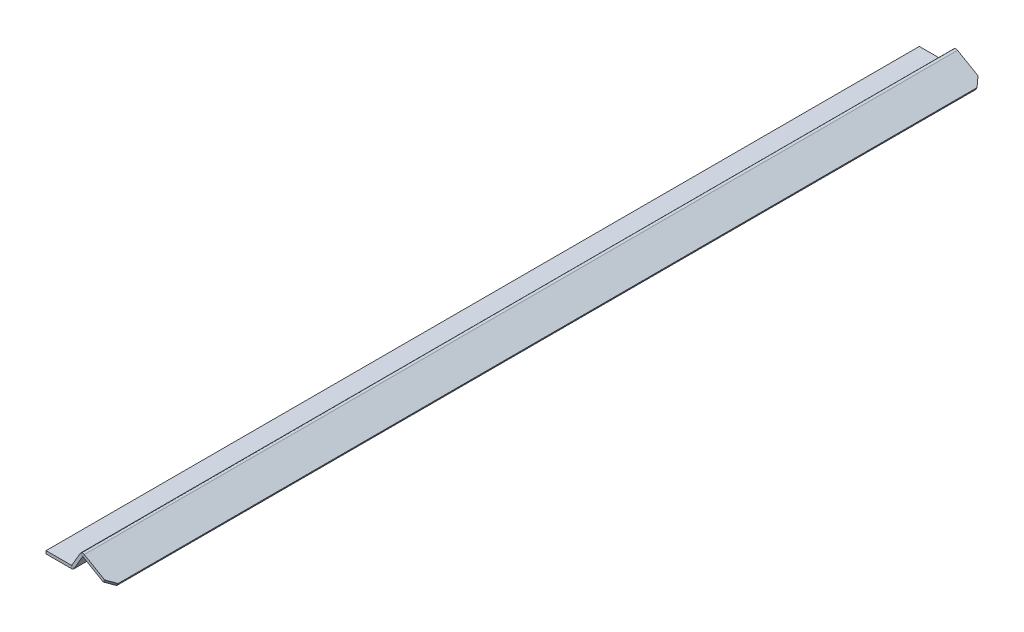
ISO-10303-21;
HEADER;
FILE_DESCRIPTION(('STEP AP214'),'2;1');
FILE_NAME('part.step','',(''),(''),'','','');
FILE_SCHEMA(('AUTOMOTIVE_DESIGN { 1 0 10303 214 1 1 1 1 }'));
ENDSEC;
DATA;
#1=APPLICATION_CONTEXT('core data for automotive mechanical design processes');
#2=APPLICATION_PROTOCOL_DEFINITION('international standard','automotive_design',2000,#1);
#3=PRODUCT_CONTEXT('',#1,'mechanical');
#4=PRODUCT('Part','Part','',(#3));
#5=PRODUCT_RELATED_PRODUCT_CATEGORY('part','',(#4));
#6=PRODUCT_DEFINITION_FORMATION('','',#4);
#7=PRODUCT_DEFINITION_CONTEXT('part definition',#1,'design');
#8=PRODUCT_DEFINITION('design','',#6,#7);
#9=PRODUCT_DEFINITION_SHAPE('','',#8);
#10=(LENGTH_UNIT() NAMED_UNIT(*) SI_UNIT(.MILLI.,.METRE.));
#11=(NAMED_UNIT(*) PLANE_ANGLE_UNIT() SI_UNIT($,.RADIAN.));
#12=(NAMED_UNIT(*) SI_UNIT($,.STERADIAN.) SOLID_ANGLE_UNIT());
#13=UNCERTAINTY_MEASURE_WITH_UNIT(LENGTH_MEASURE(1.E-05),#10,'distance_accuracy_value','');
#14=(GEOMETRIC_REPRESENTATION_CONTEXT(3) GLOBAL_UNCERTAINTY_ASSIGNED_CONTEXT((#13)) GLOBAL_UNIT_ASSIGNED_CONTEXT((#10,
#11,#12)) REPRESENTATION_CONTEXT('',''));
#15=CARTESIAN_POINT('',(0.,0.,0.));
#16=DIRECTION('',(0.,0.,1.));
#17=DIRECTION('',(1.,0.,0.));
#18=AXIS2_PLACEMENT_3D('',#15,#16,#17);
#19=CARTESIAN_POINT('',(17.7875644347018,0.,303.5));
#20=DIRECTION('',(0.,0.,1.));
#21=DIRECTION('',(1.,0.,0.));
#22=AXIS2_PLACEMENT_3D('',#19,#20,#21);
#23=PLANE('',#22);
#24=DIRECTION('',(0.,1.,0.));
#25=VECTOR('',#24,1.);
#26=CARTESIAN_POINT('',(17.7875644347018,0.,303.5));
#27=LINE('',#26,#25);
#28=CARTESIAN_POINT('',(17.7875644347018,0.,303.5));
#29=VERTEX_POINT('',#28);
#30=CARTESIAN_POINT('',(17.7875644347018,2.,303.5));
#31=VERTEX_POINT('',#30);
#32=EDGE_CURVE('E274',#29,#31,#27,.T.);
#33=ORIENTED_EDGE('',*,*,#32,.F.);
#34=CARTESIAN_POINT('',(17.7875644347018,2.1,303.5));
#35=DIRECTION('',(0.,0.,-1.));
#36=DIRECTION('',(-1.,0.,0.));
#37=AXIS2_PLACEMENT_3D('',#34,#35,#36);
#38=CIRCLE('',#37,2.1);
#39=CARTESIAN_POINT('',(19.6062177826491,1.05,303.5));
#40=VERTEX_POINT('',#39);
#41=EDGE_CURVE('E201',#29,#40,#38,.F.);
#42=ORIENTED_EDGE('',*,*,#41,.T.);
#43=DIRECTION('',(0.86602540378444,-0.499999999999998,0.));
#44=VECTOR('',#43,1.);
#45=CARTESIAN_POINT('',(17.8741669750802,2.05,303.5));
#46=LINE('',#45,#44);
#47=CARTESIAN_POINT('',(17.8741669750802,2.05,303.5));
#48=VERTEX_POINT('',#47);
#49=EDGE_CURVE('E272',#48,#40,#46,.T.);
#50=ORIENTED_EDGE('',*,*,#49,.F.);
#51=CARTESIAN_POINT('',(17.7875644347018,2.1,303.5));
#52=DIRECTION('',(0.,0.,1.));
#53=DIRECTION('',(1.,0.,0.));
#54=AXIS2_PLACEMENT_3D('',#51,#52,#53);
#55=CIRCLE('',#54,0.0999999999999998);
#56=EDGE_CURVE('E186',#31,#48,#55,.T.);
#57=ORIENTED_EDGE('',*,*,#56,.F.);
#58=EDGE_LOOP('',(#33,#42,#50,#57));
#59=FACE_BOUND('',#58,.T.);
#60=ADVANCED_FACE('F50',(#59),#23,.T.);
#61=CARTESIAN_POINT('',(17.8741669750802,2.05,303.5));
#62=DIRECTION('',(0.,0.,1.));
#63=DIRECTION('',(1.,0.,0.));
#64=AXIS2_PLACEMENT_3D('',#61,#62,#63);
#65=PLANE('',#64);
#66=DIRECTION('',(1.,0.,0.));
#67=VECTOR('',#66,1.);
#68=CARTESIAN_POINT('',(0.,0.,303.5));
#69=LINE('',#68,#67);
#70=CARTESIAN_POINT('',(0.,0.,303.5));
#71=VERTEX_POINT('',#70);
#72=EDGE_CURVE('E198',#71,#29,#69,.T.);
#73=ORIENTED_EDGE('',*,*,#72,.T.);
#74=ORIENTED_EDGE('',*,*,#32,.T.);
#75=DIRECTION('',(1.,0.,0.));
#76=VECTOR('',#75,1.);
#77=CARTESIAN_POINT('',(0.,2.,303.5));
#78=LINE('',#77,#76);
#79=CARTESIAN_POINT('',(0.,2.,303.5));
#80=VERTEX_POINT('',#79);
#81=EDGE_CURVE('E192',#80,#31,#78,.T.);
#82=ORIENTED_EDGE('',*,*,#81,.F.);
#83=DIRECTION('',(0.,1.,0.));
#84=VECTOR('',#83,1.);
#85=CARTESIAN_POINT('',(0.,0.,303.5));
#86=LINE('',#85,#84);
#87=EDGE_CURVE('E195',#71,#80,#86,.T.);
#88=ORIENTED_EDGE('',*,*,#87,.F.);
#89=EDGE_LOOP('',(#73,#74,#82,#88));
#90=FACE_BOUND('',#89,.T.);
#91=ADVANCED_FACE('F316',(#90),#65,.T.);
#92=CARTESIAN_POINT('',(19.6062177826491,1.05,-303.5));
#93=DIRECTION('',(0.,0.,-1.));
#94=DIRECTION('',(-1.,0.,0.));
#95=AXIS2_PLACEMENT_3D('',#92,#93,#94);
#96=PLANE('',#95);
#97=DIRECTION('',(-0.86602540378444,0.499999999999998,0.));
#98=VECTOR('',#97,1.);
#99=CARTESIAN_POINT('',(19.6062177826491,1.05,-303.5));
#100=LINE('',#99,#98);
#101=CARTESIAN_POINT('',(19.6062177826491,1.05,-303.5));
#102=VERTEX_POINT('',#101);
#103=CARTESIAN_POINT('',(17.8741669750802,2.05,-303.5));
#104=VERTEX_POINT('',#103);
#105=EDGE_CURVE('E270',#102,#104,#100,.T.);
#106=ORIENTED_EDGE('',*,*,#105,.F.);
#107=CARTESIAN_POINT('',(17.7875644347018,2.1,-303.5));
#108=DIRECTION('',(0.,0.,-1.));
#109=DIRECTION('',(-1.,0.,0.));
#110=AXIS2_PLACEMENT_3D('',#107,#108,#109);
#111=CIRCLE('',#110,2.1);
#112=CARTESIAN_POINT('',(17.7875644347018,0.,-303.5));
#113=VERTEX_POINT('',#112);
#114=EDGE_CURVE('E230',#113,#102,#111,.F.);
#115=ORIENTED_EDGE('',*,*,#114,.F.);
#116=DIRECTION('',(0.,-1.,0.));
#117=VECTOR('',#116,1.);
#118=CARTESIAN_POINT('',(17.7875644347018,2.,-303.5));
#119=LINE('',#118,#117);
#120=CARTESIAN_POINT('',(17.7875644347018,2.,-303.5));
#121=VERTEX_POINT('',#120);
#122=EDGE_CURVE('E268',#121,#113,#119,.T.);
#123=ORIENTED_EDGE('',*,*,#122,.F.);
#124=CARTESIAN_POINT('',(17.7875644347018,2.1,-303.5));
#125=DIRECTION('',(0.,0.,1.));
#126=DIRECTION('',(1.,0.,0.));
#127=AXIS2_PLACEMENT_3D('',#124,#125,#126);
#128=CIRCLE('',#127,0.0999999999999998);
#129=EDGE_CURVE('E218',#121,#104,#128,.T.);
#130=ORIENTED_EDGE('',*,*,#129,.T.);
#131=EDGE_LOOP('',(#106,#115,#123,#130));
#132=FACE_BOUND('',#131,.T.);
#133=ADVANCED_FACE('F322',(#132),#96,.T.);
#134=CARTESIAN_POINT('',(17.7875644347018,2.,-303.5));
#135=DIRECTION('',(0.,0.,-1.));
#136=DIRECTION('',(-1.,0.,0.));
#137=AXIS2_PLACEMENT_3D('',#134,#135,#136);
#138=PLANE('',#137);
#139=DIRECTION('',(0.499999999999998,0.86602540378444,0.));
#140=VECTOR('',#139,1.);
#141=CARTESIAN_POINT('',(19.,0.,-303.5));
#142=LINE('',#141,#140);
#143=CARTESIAN_POINT('',(25.45,11.1717277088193,-303.5));
#144=VERTEX_POINT('',#143);
#145=EDGE_CURVE('E233',#102,#144,#142,.T.);
#146=ORIENTED_EDGE('',*,*,#145,.F.);
#147=ORIENTED_EDGE('',*,*,#105,.T.);
#148=DIRECTION('',(0.499999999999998,0.86602540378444,0.));
#149=VECTOR('',#148,1.);
#150=CARTESIAN_POINT('',(17.2679491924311,0.999999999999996,-303.5));
#151=LINE('',#150,#149);
#152=CARTESIAN_POINT('',(23.7179491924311,12.1717277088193,-303.5));
#153=VERTEX_POINT('',#152);
#154=EDGE_CURVE('E215',#104,#153,#151,.T.);
#155=ORIENTED_EDGE('',*,*,#154,.T.);
#156=DIRECTION('',(0.866025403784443,-0.499999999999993,0.));
#157=VECTOR('',#156,1.);
#158=CARTESIAN_POINT('',(23.7179491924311,12.1717277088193,-303.5));
#159=LINE('',#158,#157);
#160=EDGE_CURVE('E264',#153,#144,#159,.T.);
#161=ORIENTED_EDGE('',*,*,#160,.T.);
#162=EDGE_LOOP('',(#146,#147,#155,#161));
#163=FACE_BOUND('',#162,.T.);
#164=ADVANCED_FACE('F328',(#163),#138,.T.);
#165=CARTESIAN_POINT('',(25.45,11.1717277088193,303.5));
#166=DIRECTION('',(0.,0.,1.));
#167=DIRECTION('',(1.,0.,0.));
#168=AXIS2_PLACEMENT_3D('',#165,#166,#167);
#169=PLANE('',#168);
#170=DIRECTION('',(-0.866025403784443,0.499999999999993,0.));
#171=VECTOR('',#170,1.);
#172=CARTESIAN_POINT('',(25.45,11.1717277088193,303.5));
#173=LINE('',#172,#171);
#174=CARTESIAN_POINT('',(25.45,11.1717277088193,303.5));
#175=VERTEX_POINT('',#174);
#176=CARTESIAN_POINT('',(23.7179491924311,12.1717277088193,303.5));
#177=VERTEX_POINT('',#176);
#178=EDGE_CURVE('E160',#175,#177,#173,.T.);
#179=ORIENTED_EDGE('',*,*,#178,.F.);
#180=CARTESIAN_POINT('',(25.5366025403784,11.1217277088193,303.5));
#181=DIRECTION('',(0.,0.,1.));
#182=DIRECTION('',(1.,0.,0.));
#183=AXIS2_PLACEMENT_3D('',#180,#181,#182);
#184=CIRCLE('',#183,0.1);
#185=CARTESIAN_POINT('',(25.5866025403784,11.2083302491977,303.5));
#186=VERTEX_POINT('',#185);
#187=EDGE_CURVE('E158',#175,#186,#184,.F.);
#188=ORIENTED_EDGE('',*,*,#187,.T.);
#189=DIRECTION('',(-0.499999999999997,-0.86602540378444,0.));
#190=VECTOR('',#189,1.);
#191=CARTESIAN_POINT('',(26.5866025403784,12.9403810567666,303.5));
#192=LINE('',#191,#190);
#193=CARTESIAN_POINT('',(26.5866025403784,12.9403810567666,303.5));
#194=VERTEX_POINT('',#193);
#195=EDGE_CURVE('E151',#194,#186,#192,.T.);
#196=ORIENTED_EDGE('',*,*,#195,.F.);
#197=CARTESIAN_POINT('',(25.5366025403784,11.1217277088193,303.5));
#198=DIRECTION('',(0.,0.,1.));
#199=DIRECTION('',(1.,0.,0.));
#200=AXIS2_PLACEMENT_3D('',#197,#198,#199);
#201=CIRCLE('',#200,2.1);
#202=EDGE_CURVE('E155',#177,#194,#201,.F.);
#203=ORIENTED_EDGE('',*,*,#202,.F.);
#204=EDGE_LOOP('',(#179,#188,#196,#203));
#205=FACE_BOUND('',#204,.T.);
#206=ADVANCED_FACE('F153',(#205),#169,.T.);
#207=CARTESIAN_POINT('',(26.5866025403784,12.9403810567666,303.5));
#208=DIRECTION('',(0.,0.,1.));
#209=DIRECTION('',(1.,0.,0.));
#210=AXIS2_PLACEMENT_3D('',#207,#208,#209);
#211=PLANE('',#210);
#212=DIRECTION('',(0.499999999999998,0.86602540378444,0.));
#213=VECTOR('',#212,1.);
#214=CARTESIAN_POINT('',(19.,0.,303.5));
#215=LINE('',#214,#213);
#216=EDGE_CURVE('E204',#40,#175,#215,.T.);
#217=ORIENTED_EDGE('',*,*,#216,.T.);
#218=ORIENTED_EDGE('',*,*,#178,.T.);
#219=DIRECTION('',(0.499999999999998,0.86602540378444,0.));
#220=VECTOR('',#219,1.);
#221=CARTESIAN_POINT('',(17.2679491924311,0.999999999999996,303.5));
#222=LINE('',#221,#220);
#223=EDGE_CURVE('E184',#48,#177,#222,.T.);
#224=ORIENTED_EDGE('',*,*,#223,.F.);
#225=ORIENTED_EDGE('',*,*,#49,.T.);
#226=EDGE_LOOP('',(#217,#218,#224,#225));
#227=FACE_BOUND('',#226,.T.);
#228=ADVANCED_FACE('F335',(#227),#211,.T.);
#229=CARTESIAN_POINT('',(25.5866025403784,11.2083302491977,-303.5));
#230=DIRECTION('',(0.,0.,-1.));
#231=DIRECTION('',(-1.,0.,0.));
#232=AXIS2_PLACEMENT_3D('',#229,#230,#231);
#233=PLANE('',#232);
#234=DIRECTION('',(0.499999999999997,0.86602540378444,0.));
#235=VECTOR('',#234,1.);
#236=CARTESIAN_POINT('',(25.5866025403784,11.2083302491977,-303.5));
#237=LINE('',#236,#235);
#238=CARTESIAN_POINT('',(25.5866025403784,11.2083302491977,-303.5));
#239=VERTEX_POINT('',#238);
#240=CARTESIAN_POINT('',(26.5866025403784,12.9403810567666,-303.5));
#241=VERTEX_POINT('',#240);
#242=EDGE_CURVE('E161',#239,#241,#237,.T.);
#243=ORIENTED_EDGE('',*,*,#242,.F.);
#244=CARTESIAN_POINT('',(25.5366025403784,11.1217277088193,-303.5));
#245=DIRECTION('',(0.,0.,1.));
#246=DIRECTION('',(1.,0.,0.));
#247=AXIS2_PLACEMENT_3D('',#244,#245,#246);
#248=CIRCLE('',#247,0.1);
#249=EDGE_CURVE('E236',#144,#239,#248,.F.);
#250=ORIENTED_EDGE('',*,*,#249,.F.);
#251=ORIENTED_EDGE('',*,*,#160,.F.);
#252=CARTESIAN_POINT('',(25.5366025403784,11.1217277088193,-303.5));
#253=DIRECTION('',(0.,0.,1.));
#254=DIRECTION('',(1.,0.,0.));
#255=AXIS2_PLACEMENT_3D('',#252,#253,#254);
#256=CIRCLE('',#255,2.1);
#257=EDGE_CURVE('E213',#153,#241,#256,.F.);
#258=ORIENTED_EDGE('',*,*,#257,.T.);
#259=EDGE_LOOP('',(#243,#250,#251,#258));
#260=FACE_BOUND('',#259,.T.);
#261=ADVANCED_FACE('F306',(#260),#233,.T.);
#262=CARTESIAN_POINT('',(23.7179491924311,12.1717277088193,-303.5));
#263=DIRECTION('',(0.,0.,-1.));
#264=DIRECTION('',(-1.,0.,0.));
#265=AXIS2_PLACEMENT_3D('',#262,#263,#264);
#266=PLANE('',#265);
#267=DIRECTION('',(0.86602540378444,-0.499999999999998,0.));
#268=VECTOR('',#267,1.);
#269=CARTESIAN_POINT('',(26.5,12.9903810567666,-303.5));
#270=LINE('',#269,#268);
#271=CARTESIAN_POINT('',(40.789419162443,4.74038105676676,-303.5));
#272=VERTEX_POINT('',#271);
#273=EDGE_CURVE('E171',#241,#272,#270,.T.);
#274=ORIENTED_EDGE('',*,*,#273,.T.);
#275=DIRECTION('',(-0.5,-0.866025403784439,0.));
#276=VECTOR('',#275,1.);
#277=CARTESIAN_POINT('',(39.7394191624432,2.92172770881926,-303.5));
#278=LINE('',#277,#276);
#279=CARTESIAN_POINT('',(39.7894191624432,3.00833024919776,-303.5));
#280=VERTEX_POINT('',#279);
#281=EDGE_CURVE('E276',#272,#280,#278,.T.);
#282=ORIENTED_EDGE('',*,*,#281,.T.);
#283=DIRECTION('',(0.86602540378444,-0.499999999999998,0.));
#284=VECTOR('',#283,1.);
#285=CARTESIAN_POINT('',(25.5,11.2583302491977,-303.5));
#286=LINE('',#285,#284);
#287=EDGE_CURVE('E209',#239,#280,#286,.T.);
#288=ORIENTED_EDGE('',*,*,#287,.F.);
#289=ORIENTED_EDGE('',*,*,#242,.T.);
#290=EDGE_LOOP('',(#274,#282,#288,#289));
#291=FACE_BOUND('',#290,.T.);
#292=ADVANCED_FACE('F303',(#291),#266,.T.);
#293=CARTESIAN_POINT('',(25.5,11.2583302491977,303.5));
#294=DIRECTION('',(0.499999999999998,0.86602540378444,0.));
#295=DIRECTION('',(-0.86602540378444,0.499999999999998,0.));
#296=AXIS2_PLACEMENT_3D('',#293,#294,#295);
#297=PLANE('',#296);
#298=DIRECTION('',(0.,0.,-1.));
#299=VECTOR('',#298,1.);
#300=CARTESIAN_POINT('',(44.1195461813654,0.508330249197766,303.5));
#301=LINE('',#300,#299);
#302=CARTESIAN_POINT('',(44.1195461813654,0.508330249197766,298.5));
#303=VERTEX_POINT('',#302);
#304=CARTESIAN_POINT('',(44.1195461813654,0.508330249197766,-298.5));
#305=VERTEX_POINT('',#304);
#306=EDGE_CURVE('E262',#303,#305,#301,.T.);
#307=ORIENTED_EDGE('',*,*,#306,.F.);
#308=DIRECTION('',(0.612372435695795,-0.353553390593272,-0.707106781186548));
#309=VECTOR('',#308,1.);
#310=CARTESIAN_POINT('',(44.1195461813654,0.508330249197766,298.5));
#311=LINE('',#310,#309);
#312=CARTESIAN_POINT('',(39.7894191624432,3.00833024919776,303.5));
#313=VERTEX_POINT('',#312);
#314=EDGE_CURVE('E72',#303,#313,#311,.F.);
#315=ORIENTED_EDGE('',*,*,#314,.T.);
#316=DIRECTION('',(0.86602540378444,-0.499999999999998,0.));
#317=VECTOR('',#316,1.);
#318=CARTESIAN_POINT('',(25.5,11.2583302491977,303.5));
#319=LINE('',#318,#317);
#320=EDGE_CURVE('E179',#186,#313,#319,.T.);
#321=ORIENTED_EDGE('',*,*,#320,.F.);
#322=DIRECTION('',(0.,0.,-1.));
#323=VECTOR('',#322,1.);
#324=CARTESIAN_POINT('',(25.5866025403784,11.2083302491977,303.5));
#325=LINE('',#324,#323);
#326=EDGE_CURVE('E208',#186,#239,#325,.T.);
#327=ORIENTED_EDGE('',*,*,#326,.T.);
#328=ORIENTED_EDGE('',*,*,#287,.T.);
#329=DIRECTION('',(-0.612372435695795,0.353553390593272,-0.707106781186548));
#330=VECTOR('',#329,1.);
#331=CARTESIAN_POINT('',(39.7894191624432,3.00833024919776,-303.5));
#332=LINE('',#331,#330);
#333=EDGE_CURVE('E279',#280,#305,#332,.F.);
#334=ORIENTED_EDGE('',*,*,#333,.T.);
#335=EDGE_LOOP('',(#307,#315,#321,#327,#328,#334));
#336=FACE_BOUND('',#335,.T.);
#337=ADVANCED_FACE('F295',(#336),#297,.F.);
#338=CARTESIAN_POINT('',(45.1195461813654,2.24038105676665,303.5));
#339=DIRECTION('',(0.866025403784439,-0.5,0.));
#340=DIRECTION('',(0.5,0.866025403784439,0.));
#341=AXIS2_PLACEMENT_3D('',#338,#339,#340);
#342=PLANE('',#341);
#343=DIRECTION('',(0.,0.,-1.));
#344=VECTOR('',#343,1.);
#345=CARTESIAN_POINT('',(45.1195461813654,2.24038105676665,303.5));
#346=LINE('',#345,#344);
#347=CARTESIAN_POINT('',(45.1195461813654,2.24038105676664,298.5));
#348=VERTEX_POINT('',#347);
#349=CARTESIAN_POINT('',(45.1195461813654,2.24038105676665,-298.5));
#350=VERTEX_POINT('',#349);
#351=EDGE_CURVE('E175',#348,#350,#346,.T.);
#352=ORIENTED_EDGE('',*,*,#351,.F.);
#353=DIRECTION('',(-0.5,-0.866025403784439,0.));
#354=VECTOR('',#353,1.);
#355=CARTESIAN_POINT('',(45.1195461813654,2.24038105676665,298.5));
#356=LINE('',#355,#354);
#357=EDGE_CURVE('E287',#348,#303,#356,.T.);
#358=ORIENTED_EDGE('',*,*,#357,.T.);
#359=ORIENTED_EDGE('',*,*,#306,.T.);
#360=DIRECTION('',(0.5,0.866025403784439,0.));
#361=VECTOR('',#360,1.);
#362=CARTESIAN_POINT('',(45.1195461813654,2.24038105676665,-298.5));
#363=LINE('',#362,#361);
#364=EDGE_CURVE('E282',#305,#350,#363,.T.);
#365=ORIENTED_EDGE('',*,*,#364,.T.);
#366=EDGE_LOOP('',(#352,#358,#359,#365));
#367=FACE_BOUND('',#366,.T.);
#368=ADVANCED_FACE('F293',(#367),#342,.T.);
#369=CARTESIAN_POINT('',(26.5,12.9903810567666,303.5));
#370=DIRECTION('',(0.499999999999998,0.86602540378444,0.));
#371=DIRECTION('',(-0.86602540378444,0.499999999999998,0.));
#372=AXIS2_PLACEMENT_3D('',#369,#370,#371);
#373=PLANE('',#372);
#374=DIRECTION('',(0.86602540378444,-0.499999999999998,0.));
#375=VECTOR('',#374,1.);
#376=CARTESIAN_POINT('',(26.5,12.9903810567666,303.5));
#377=LINE('',#376,#375);
#378=CARTESIAN_POINT('',(40.7894191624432,4.74038105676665,303.5));
#379=VERTEX_POINT('',#378);
#380=EDGE_CURVE('E168',#194,#379,#377,.T.);
#381=ORIENTED_EDGE('',*,*,#380,.T.);
#382=DIRECTION('',(-0.612372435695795,0.353553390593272,0.707106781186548));
#383=VECTOR('',#382,1.);
#384=CARTESIAN_POINT('',(33.6447095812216,8.86538105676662,311.75));
#385=LINE('',#384,#383);
#386=EDGE_CURVE('E13',#379,#348,#385,.F.);
#387=ORIENTED_EDGE('',*,*,#386,.T.);
#388=ORIENTED_EDGE('',*,*,#351,.T.);
#389=DIRECTION('',(0.612372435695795,-0.353553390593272,0.707106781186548));
#390=VECTOR('',#389,1.);
#391=CARTESIAN_POINT('',(296.483419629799,-142.884618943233,-8.24999999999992));
#392=LINE('',#391,#390);
#393=EDGE_CURVE('E285',#350,#272,#392,.F.);
#394=ORIENTED_EDGE('',*,*,#393,.T.);
#395=ORIENTED_EDGE('',*,*,#273,.F.);
#396=DIRECTION('',(0.,0.,-1.));
#397=VECTOR('',#396,1.);
#398=CARTESIAN_POINT('',(26.5866025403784,12.9403810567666,303.5));
#399=LINE('',#398,#397);
#400=EDGE_CURVE('E166',#194,#241,#399,.T.);
#401=ORIENTED_EDGE('',*,*,#400,.F.);
#402=EDGE_LOOP('',(#381,#387,#388,#394,#395,#401));
#403=FACE_BOUND('',#402,.T.);
#404=ADVANCED_FACE('F167',(#403),#373,.T.);
#405=CARTESIAN_POINT('',(25.5366025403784,11.1217277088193,303.5));
#406=DIRECTION('',(0.,0.,-1.));
#407=DIRECTION('',(-1.,0.,0.));
#408=AXIS2_PLACEMENT_3D('',#405,#406,#407);
#409=CYLINDRICAL_SURFACE('',#408,2.1);
#410=ORIENTED_EDGE('',*,*,#257,.F.);
#411=DIRECTION('',(0.,0.,-1.));
#412=VECTOR('',#411,1.);
#413=CARTESIAN_POINT('',(23.7179491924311,12.1717277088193,303.5));
#414=LINE('',#413,#412);
#415=EDGE_CURVE('E176',#177,#153,#414,.T.);
#416=ORIENTED_EDGE('',*,*,#415,.F.);
#417=ORIENTED_EDGE('',*,*,#202,.T.);
#418=ORIENTED_EDGE('',*,*,#400,.T.);
#419=EDGE_LOOP('',(#410,#416,#417,#418));
#420=FACE_BOUND('',#419,.T.);
#421=ADVANCED_FACE('F182',(#420),#409,.T.);
#422=CARTESIAN_POINT('',(17.2679491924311,0.999999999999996,303.5));
#423=DIRECTION('',(-0.86602540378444,0.499999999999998,0.));
#424=DIRECTION('',(-0.499999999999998,-0.86602540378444,0.));
#425=AXIS2_PLACEMENT_3D('',#422,#423,#424);
#426=PLANE('',#425);
#427=ORIENTED_EDGE('',*,*,#154,.F.);
#428=DIRECTION('',(0.,0.,-1.));
#429=VECTOR('',#428,1.);
#430=CARTESIAN_POINT('',(17.8741669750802,2.05,303.5));
#431=LINE('',#430,#429);
#432=EDGE_CURVE('E257',#48,#104,#431,.T.);
#433=ORIENTED_EDGE('',*,*,#432,.F.);
#434=ORIENTED_EDGE('',*,*,#223,.T.);
#435=ORIENTED_EDGE('',*,*,#415,.T.);
#436=EDGE_LOOP('',(#427,#433,#434,#435));
#437=FACE_BOUND('',#436,.T.);
#438=ADVANCED_FACE('F351',(#437),#426,.T.);
#439=CARTESIAN_POINT('',(17.7875644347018,2.1,303.5));
#440=DIRECTION('',(0.,0.,-1.));
#441=DIRECTION('',(-1.,0.,0.));
#442=AXIS2_PLACEMENT_3D('',#439,#440,#441);
#443=CYLINDRICAL_SURFACE('',#442,0.0999999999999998);
#444=ORIENTED_EDGE('',*,*,#129,.F.);
#445=DIRECTION('',(0.,0.,-1.));
#446=VECTOR('',#445,1.);
#447=CARTESIAN_POINT('',(17.7875644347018,2.,303.5));
#448=LINE('',#447,#446);
#449=EDGE_CURVE('E254',#31,#121,#448,.T.);
#450=ORIENTED_EDGE('',*,*,#449,.F.);
#451=ORIENTED_EDGE('',*,*,#56,.T.);
#452=ORIENTED_EDGE('',*,*,#432,.T.);
#453=EDGE_LOOP('',(#444,#450,#451,#452));
#454=FACE_BOUND('',#453,.T.);
#455=ADVANCED_FACE('F354',(#454),#443,.F.);
#456=CARTESIAN_POINT('',(0.,2.,303.5));
#457=DIRECTION('',(0.,1.,0.));
#458=DIRECTION('',(0.,0.,1.));
#459=AXIS2_PLACEMENT_3D('',#456,#457,#458);
#460=PLANE('',#459);
#461=DIRECTION('',(1.,0.,0.));
#462=VECTOR('',#461,1.);
#463=CARTESIAN_POINT('',(0.,2.,-303.5));
#464=LINE('',#463,#462);
#465=CARTESIAN_POINT('',(0.,2.,-303.5));
#466=VERTEX_POINT('',#465);
#467=EDGE_CURVE('E221',#466,#121,#464,.T.);
#468=ORIENTED_EDGE('',*,*,#467,.F.);
#469=DIRECTION('',(0.,0.,-1.));
#470=VECTOR('',#469,1.);
#471=CARTESIAN_POINT('',(0.,2.,303.5));
#472=LINE('',#471,#470);
#473=EDGE_CURVE('E252',#80,#466,#472,.T.);
#474=ORIENTED_EDGE('',*,*,#473,.F.);
#475=ORIENTED_EDGE('',*,*,#81,.T.);
#476=ORIENTED_EDGE('',*,*,#449,.T.);
#477=EDGE_LOOP('',(#468,#474,#475,#476));
#478=FACE_BOUND('',#477,.T.);
#479=ADVANCED_FACE('F358',(#478),#460,.T.);
#480=CARTESIAN_POINT('',(0.,0.,303.5));
#481=DIRECTION('',(-1.,0.,0.));
#482=DIRECTION('',(0.,0.,1.));
#483=AXIS2_PLACEMENT_3D('',#480,#481,#482);
#484=PLANE('',#483);
#485=DIRECTION('',(0.,1.,0.));
#486=VECTOR('',#485,1.);
#487=CARTESIAN_POINT('',(0.,0.,-303.5));
#488=LINE('',#487,#486);
#489=CARTESIAN_POINT('',(0.,0.,-303.5));
#490=VERTEX_POINT('',#489);
#491=EDGE_CURVE('E224',#490,#466,#488,.T.);
#492=ORIENTED_EDGE('',*,*,#491,.F.);
#493=DIRECTION('',(0.,0.,-1.));
#494=VECTOR('',#493,1.);
#495=CARTESIAN_POINT('',(0.,0.,303.5));
#496=LINE('',#495,#494);
#497=EDGE_CURVE('E250',#71,#490,#496,.T.);
#498=ORIENTED_EDGE('',*,*,#497,.F.);
#499=ORIENTED_EDGE('',*,*,#87,.T.);
#500=ORIENTED_EDGE('',*,*,#473,.T.);
#501=EDGE_LOOP('',(#492,#498,#499,#500));
#502=FACE_BOUND('',#501,.T.);
#503=ADVANCED_FACE('F362',(#502),#484,.T.);
#504=CARTESIAN_POINT('',(0.,0.,303.5));
#505=DIRECTION('',(0.,1.,0.));
#506=DIRECTION('',(0.,0.,1.));
#507=AXIS2_PLACEMENT_3D('',#504,#505,#506);
#508=PLANE('',#507);
#509=DIRECTION('',(1.,0.,0.));
#510=VECTOR('',#509,1.);
#511=CARTESIAN_POINT('',(0.,0.,-303.5));
#512=LINE('',#511,#510);
#513=EDGE_CURVE('E227',#490,#113,#512,.T.);
#514=ORIENTED_EDGE('',*,*,#513,.T.);
#515=DIRECTION('',(0.,0.,-1.));
#516=VECTOR('',#515,1.);
#517=CARTESIAN_POINT('',(17.7875644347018,0.,303.5));
#518=LINE('',#517,#516);
#519=EDGE_CURVE('E247',#29,#113,#518,.T.);
#520=ORIENTED_EDGE('',*,*,#519,.F.);
#521=ORIENTED_EDGE('',*,*,#72,.F.);
#522=ORIENTED_EDGE('',*,*,#497,.T.);
#523=EDGE_LOOP('',(#514,#520,#521,#522));
#524=FACE_BOUND('',#523,.T.);
#525=ADVANCED_FACE('F366',(#524),#508,.F.);
#526=CARTESIAN_POINT('',(17.7875644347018,2.1,303.5));
#527=DIRECTION('',(0.,0.,-1.));
#528=DIRECTION('',(-1.,0.,0.));
#529=AXIS2_PLACEMENT_3D('',#526,#527,#528);
#530=CYLINDRICAL_SURFACE('',#529,2.1);
#531=ORIENTED_EDGE('',*,*,#114,.T.);
#532=DIRECTION('',(0.,0.,-1.));
#533=VECTOR('',#532,1.);
#534=CARTESIAN_POINT('',(19.6062177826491,1.05,303.5));
#535=LINE('',#534,#533);
#536=EDGE_CURVE('E244',#40,#102,#535,.T.);
#537=ORIENTED_EDGE('',*,*,#536,.F.);
#538=ORIENTED_EDGE('',*,*,#41,.F.);
#539=ORIENTED_EDGE('',*,*,#519,.T.);
#540=EDGE_LOOP('',(#531,#537,#538,#539));
#541=FACE_BOUND('',#540,.T.);
#542=ADVANCED_FACE('F370',(#541),#530,.T.);
#543=CARTESIAN_POINT('',(19.,0.,303.5));
#544=DIRECTION('',(-0.86602540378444,0.499999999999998,0.));
#545=DIRECTION('',(-0.499999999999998,-0.86602540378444,0.));
#546=AXIS2_PLACEMENT_3D('',#543,#544,#545);
#547=PLANE('',#546);
#548=ORIENTED_EDGE('',*,*,#145,.T.);
#549=DIRECTION('',(0.,0.,-1.));
#550=VECTOR('',#549,1.);
#551=CARTESIAN_POINT('',(25.45,11.1717277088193,303.5));
#552=LINE('',#551,#550);
#553=EDGE_CURVE('E241',#175,#144,#552,.T.);
#554=ORIENTED_EDGE('',*,*,#553,.F.);
#555=ORIENTED_EDGE('',*,*,#216,.F.);
#556=ORIENTED_EDGE('',*,*,#536,.T.);
#557=EDGE_LOOP('',(#548,#554,#555,#556));
#558=FACE_BOUND('',#557,.T.);
#559=ADVANCED_FACE('F374',(#558),#547,.F.);
#560=CARTESIAN_POINT('',(25.5366025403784,11.1217277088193,303.5));
#561=DIRECTION('',(0.,0.,-1.));
#562=DIRECTION('',(-1.,0.,0.));
#563=AXIS2_PLACEMENT_3D('',#560,#561,#562);
#564=CYLINDRICAL_SURFACE('',#563,0.1);
#565=ORIENTED_EDGE('',*,*,#249,.T.);
#566=ORIENTED_EDGE('',*,*,#326,.F.);
#567=ORIENTED_EDGE('',*,*,#187,.F.);
#568=ORIENTED_EDGE('',*,*,#553,.T.);
#569=EDGE_LOOP('',(#565,#566,#567,#568));
#570=FACE_BOUND('',#569,.T.);
#571=ADVANCED_FACE('F308',(#570),#564,.F.);
#572=CARTESIAN_POINT('',(25.5366025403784,11.1217277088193,303.5));
#573=DIRECTION('',(0.,0.,1.));
#574=DIRECTION('',(1.,0.,0.));
#575=AXIS2_PLACEMENT_3D('',#572,#573,#574);
#576=PLANE('',#575);
#577=ORIENTED_EDGE('',*,*,#320,.T.);
#578=DIRECTION('',(0.5,0.866025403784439,0.));
#579=VECTOR('',#578,1.);
#580=CARTESIAN_POINT('',(39.7394191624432,2.92172770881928,303.5));
#581=LINE('',#580,#579);
#582=EDGE_CURVE('E58',#313,#379,#581,.T.);
#583=ORIENTED_EDGE('',*,*,#582,.T.);
#584=ORIENTED_EDGE('',*,*,#380,.F.);
#585=ORIENTED_EDGE('',*,*,#195,.T.);
#586=EDGE_LOOP('',(#577,#583,#584,#585));
#587=FACE_BOUND('',#586,.T.);
#588=ADVANCED_FACE('F178',(#587),#576,.T.);
#589=CARTESIAN_POINT('',(25.5366025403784,11.1217277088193,-303.5));
#590=DIRECTION('',(0.,0.,1.));
#591=DIRECTION('',(1.,0.,0.));
#592=AXIS2_PLACEMENT_3D('',#589,#590,#591);
#593=PLANE('',#592);
#594=ORIENTED_EDGE('',*,*,#467,.T.);
#595=ORIENTED_EDGE('',*,*,#122,.T.);
#596=ORIENTED_EDGE('',*,*,#513,.F.);
#597=ORIENTED_EDGE('',*,*,#491,.T.);
#598=EDGE_LOOP('',(#594,#595,#596,#597));
#599=FACE_BOUND('',#598,.T.);
#600=ADVANCED_FACE('F314',(#599),#593,.F.);
#601=CARTESIAN_POINT('',(39.7394191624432,2.92172770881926,-303.5));
#602=DIRECTION('',(-0.612372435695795,0.353553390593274,0.707106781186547));
#603=DIRECTION('',(0.755928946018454,0.,0.654653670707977));
#604=AXIS2_PLACEMENT_3D('',#601,#602,#603);
#605=PLANE('',#604);
#606=ORIENTED_EDGE('',*,*,#393,.F.);
#607=ORIENTED_EDGE('',*,*,#364,.F.);
#608=ORIENTED_EDGE('',*,*,#333,.F.);
#609=ORIENTED_EDGE('',*,*,#281,.F.);
#610=EDGE_LOOP('',(#606,#607,#608,#609));
#611=FACE_BOUND('',#610,.T.);
#612=ADVANCED_FACE('F301',(#611),#605,.F.);
#613=CARTESIAN_POINT('',(45.1195461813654,2.24038105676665,298.5));
#614=DIRECTION('',(-0.612372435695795,0.353553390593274,-0.707106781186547));
#615=DIRECTION('',(-0.755928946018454,0.,0.654653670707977));
#616=AXIS2_PLACEMENT_3D('',#613,#614,#615);
#617=PLANE('',#616);
#618=ORIENTED_EDGE('',*,*,#386,.F.);
#619=ORIENTED_EDGE('',*,*,#582,.F.);
#620=ORIENTED_EDGE('',*,*,#314,.F.);
#621=ORIENTED_EDGE('',*,*,#357,.F.);
#622=EDGE_LOOP('',(#618,#619,#620,#621));
#623=FACE_BOUND('',#622,.T.);
#624=ADVANCED_FACE('F52',(#623),#617,.F.);
#625=CLOSED_SHELL('',(#60,#91,#133,#164,#206,#228,#261,#292,#337,#368,#404,#421,#438,#455,#479,
#503,#525,#542,#559,#571,#588,#600,#612,#624));
#626=MANIFOLD_SOLID_BREP('B2',#625);
#627=ADVANCED_BREP_SHAPE_REPRESENTATION('',(#18,#626),#14);
#628=SHAPE_DEFINITION_REPRESENTATION(#9,#627);
ENDSEC;
END-ISO-10303-21;
